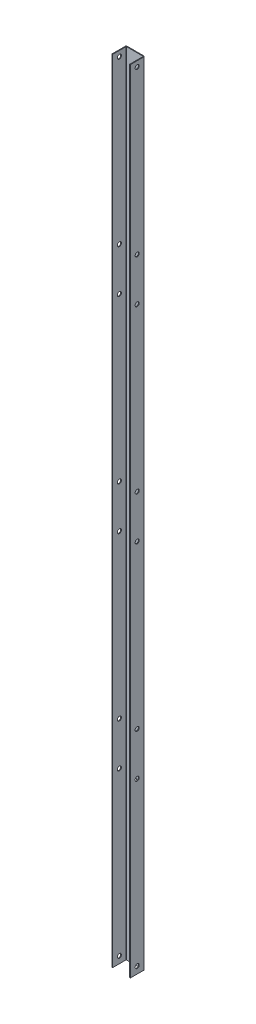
ISO-10303-21;
HEADER;
FILE_DESCRIPTION(('STEP AP214'),'2;1');
FILE_NAME('part.step','',(''),(''),'','','');
FILE_SCHEMA(('AUTOMOTIVE_DESIGN { 1 0 10303 214 1 1 1 1 }'));
ENDSEC;
DATA;
#1=APPLICATION_CONTEXT('core data for automotive mechanical design processes');
#2=APPLICATION_PROTOCOL_DEFINITION('international standard','automotive_design',2000,#1);
#3=PRODUCT_CONTEXT('',#1,'mechanical');
#4=PRODUCT('Part','Part','',(#3));
#5=PRODUCT_RELATED_PRODUCT_CATEGORY('part','',(#4));
#6=PRODUCT_DEFINITION_FORMATION('','',#4);
#7=PRODUCT_DEFINITION_CONTEXT('part definition',#1,'design');
#8=PRODUCT_DEFINITION('design','',#6,#7);
#9=PRODUCT_DEFINITION_SHAPE('','',#8);
#10=(LENGTH_UNIT() NAMED_UNIT(*) SI_UNIT(.MILLI.,.METRE.));
#11=(NAMED_UNIT(*) PLANE_ANGLE_UNIT() SI_UNIT($,.RADIAN.));
#12=(NAMED_UNIT(*) SI_UNIT($,.STERADIAN.) SOLID_ANGLE_UNIT());
#13=UNCERTAINTY_MEASURE_WITH_UNIT(LENGTH_MEASURE(1.E-05),#10,'distance_accuracy_value','');
#14=(GEOMETRIC_REPRESENTATION_CONTEXT(3) GLOBAL_UNCERTAINTY_ASSIGNED_CONTEXT((#13)) GLOBAL_UNIT_ASSIGNED_CONTEXT((#10,
#11,#12)) REPRESENTATION_CONTEXT('',''));
#15=CARTESIAN_POINT('',(0.,0.,0.));
#16=DIRECTION('',(0.,0.,1.));
#17=DIRECTION('',(1.,0.,0.));
#18=AXIS2_PLACEMENT_3D('',#15,#16,#17);
#19=CARTESIAN_POINT('',(130.,1155.,0.));
#20=DIRECTION('',(0.,-1.,0.));
#21=DIRECTION('',(0.,0.,-1.));
#22=AXIS2_PLACEMENT_3D('',#19,#20,#21);
#23=PLANE('',#22);
#24=DIRECTION('',(0.,0.,1.));
#25=VECTOR('',#24,1.);
#26=CARTESIAN_POINT('',(2.,1155.,0.));
#27=LINE('',#26,#25);
#28=CARTESIAN_POINT('',(2.,1155.,-39.2634));
#29=VERTEX_POINT('',#28);
#30=CARTESIAN_POINT('',(2.,1155.,0.));
#31=VERTEX_POINT('',#30);
#32=EDGE_CURVE('E430',#29,#31,#27,.T.);
#33=ORIENTED_EDGE('',*,*,#32,.F.);
#34=DIRECTION('',(-1.,0.,0.));
#35=VECTOR('',#34,1.);
#36=CARTESIAN_POINT('',(2.,1155.,-39.2634));
#37=LINE('',#36,#35);
#38=CARTESIAN_POINT('',(0.,1155.,-39.2634));
#39=VERTEX_POINT('',#38);
#40=EDGE_CURVE('E11',#29,#39,#37,.T.);
#41=ORIENTED_EDGE('',*,*,#40,.T.);
#42=DIRECTION('',(0.,0.,1.));
#43=VECTOR('',#42,1.);
#44=CARTESIAN_POINT('',(0.,1155.,0.));
#45=LINE('',#44,#43);
#46=CARTESIAN_POINT('',(0.,1155.,0.));
#47=VERTEX_POINT('',#46);
#48=EDGE_CURVE('E427',#39,#47,#45,.T.);
#49=ORIENTED_EDGE('',*,*,#48,.T.);
#50=DIRECTION('',(-1.,0.,0.));
#51=VECTOR('',#50,1.);
#52=CARTESIAN_POINT('',(130.,1155.,0.));
#53=LINE('',#52,#51);
#54=EDGE_CURVE('E153',#31,#47,#53,.T.);
#55=ORIENTED_EDGE('',*,*,#54,.F.);
#56=EDGE_LOOP('',(#33,#41,#49,#55));
#57=FACE_BOUND('',#56,.T.);
#58=ADVANCED_FACE('F43',(#57),#23,.F.);
#59=DIRECTION('',(1.,0.,0.));
#60=VECTOR('',#59,1.);
#61=CARTESIAN_POINT('',(0.,1155.,-40.));
#62=LINE('',#61,#60);
#63=CARTESIAN_POINT('',(-49.2634,1155.,-40.));
#64=VERTEX_POINT('',#63);
#65=CARTESIAN_POINT('',(-0.7366,1155.,-40.));
#66=VERTEX_POINT('',#65);
#67=EDGE_CURVE('E419',#64,#66,#62,.T.);
#68=ORIENTED_EDGE('',*,*,#67,.T.);
#69=DIRECTION('',(0.,0.,-1.));
#70=VECTOR('',#69,1.);
#71=CARTESIAN_POINT('',(-0.7366,1155.,-40.));
#72=LINE('',#71,#70);
#73=CARTESIAN_POINT('',(-0.7366,1155.,-42.));
#74=VERTEX_POINT('',#73);
#75=EDGE_CURVE('E53',#66,#74,#72,.T.);
#76=ORIENTED_EDGE('',*,*,#75,.T.);
#77=DIRECTION('',(1.,0.,0.));
#78=VECTOR('',#77,1.);
#79=CARTESIAN_POINT('',(0.,1155.,-42.));
#80=LINE('',#79,#78);
#81=CARTESIAN_POINT('',(-49.2634,1155.,-42.));
#82=VERTEX_POINT('',#81);
#83=EDGE_CURVE('E438',#82,#74,#80,.T.);
#84=ORIENTED_EDGE('',*,*,#83,.F.);
#85=DIRECTION('',(0.,0.,1.));
#86=VECTOR('',#85,1.);
#87=CARTESIAN_POINT('',(-49.2634,1155.,-42.));
#88=LINE('',#87,#86);
#89=EDGE_CURVE('E177',#82,#64,#88,.T.);
#90=ORIENTED_EDGE('',*,*,#89,.T.);
#91=EDGE_LOOP('',(#68,#76,#84,#90));
#92=FACE_BOUND('',#91,.T.);
#93=ADVANCED_FACE('F600',(#92),#23,.F.);
#94=ORIENTED_EDGE('',*,*,#40,.F.);
#95=CARTESIAN_POINT('',(-0.7366,1155.,-39.2634));
#96=DIRECTION('',(0.,-1.,0.));
#97=DIRECTION('',(0.,0.,-1.));
#98=AXIS2_PLACEMENT_3D('',#95,#96,#97);
#99=CIRCLE('',#98,2.7366);
#100=EDGE_CURVE('E434',#74,#29,#99,.T.);
#101=ORIENTED_EDGE('',*,*,#100,.F.);
#102=ORIENTED_EDGE('',*,*,#75,.F.);
#103=CARTESIAN_POINT('',(-0.7366,1155.,-39.2634));
#104=DIRECTION('',(0.,-1.,0.));
#105=DIRECTION('',(0.,0.,-1.));
#106=AXIS2_PLACEMENT_3D('',#103,#104,#105);
#107=CIRCLE('',#106,0.7366);
#108=EDGE_CURVE('E423',#66,#39,#107,.T.);
#109=ORIENTED_EDGE('',*,*,#108,.T.);
#110=EDGE_LOOP('',(#94,#101,#102,#109));
#111=FACE_BOUND('',#110,.T.);
#112=ADVANCED_FACE('F510',(#111),#23,.F.);
#113=DIRECTION('',(0.,0.,-1.));
#114=VECTOR('',#113,1.);
#115=CARTESIAN_POINT('',(-50.,1155.,-40.));
#116=LINE('',#115,#114);
#117=CARTESIAN_POINT('',(-50.,1155.,0.));
#118=VERTEX_POINT('',#117);
#119=CARTESIAN_POINT('',(-50.,1155.,-39.2634));
#120=VERTEX_POINT('',#119);
#121=EDGE_CURVE('E412',#118,#120,#116,.T.);
#122=ORIENTED_EDGE('',*,*,#121,.T.);
#123=DIRECTION('',(-1.,0.,0.));
#124=VECTOR('',#123,1.);
#125=CARTESIAN_POINT('',(-50.,1155.,-39.2634));
#126=LINE('',#125,#124);
#127=CARTESIAN_POINT('',(-52.,1155.,-39.2634));
#128=VERTEX_POINT('',#127);
#129=EDGE_CURVE('E61',#120,#128,#126,.T.);
#130=ORIENTED_EDGE('',*,*,#129,.T.);
#131=DIRECTION('',(0.,0.,1.));
#132=VECTOR('',#131,1.);
#133=CARTESIAN_POINT('',(-52.,1155.,0.));
#134=LINE('',#133,#132);
#135=CARTESIAN_POINT('',(-52.,1155.,0.));
#136=VERTEX_POINT('',#135);
#137=EDGE_CURVE('E133',#128,#136,#134,.T.);
#138=ORIENTED_EDGE('',*,*,#137,.T.);
#139=EDGE_CURVE('E136',#118,#136,#53,.T.);
#140=ORIENTED_EDGE('',*,*,#139,.F.);
#141=EDGE_LOOP('',(#122,#130,#138,#140));
#142=FACE_BOUND('',#141,.T.);
#143=ADVANCED_FACE('F135',(#142),#23,.F.);
#144=CARTESIAN_POINT('',(130.,-1155.,0.));
#145=DIRECTION('',(0.,1.,0.));
#146=DIRECTION('',(0.,0.,1.));
#147=AXIS2_PLACEMENT_3D('',#144,#145,#146);
#148=PLANE('',#147);
#149=DIRECTION('',(0.,0.,-1.));
#150=VECTOR('',#149,1.);
#151=CARTESIAN_POINT('',(-52.,-1155.,0.));
#152=LINE('',#151,#150);
#153=CARTESIAN_POINT('',(-52.,-1155.,0.));
#154=VERTEX_POINT('',#153);
#155=CARTESIAN_POINT('',(-52.,-1155.,-39.2634));
#156=VERTEX_POINT('',#155);
#157=EDGE_CURVE('E155',#154,#156,#152,.T.);
#158=ORIENTED_EDGE('',*,*,#157,.T.);
#159=DIRECTION('',(1.,1.11022302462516E-13,0.));
#160=VECTOR('',#159,1.);
#161=CARTESIAN_POINT('',(-52.,-1155.,-39.2634));
#162=LINE('',#161,#160);
#163=CARTESIAN_POINT('',(-50.,-1155.,-39.2634));
#164=VERTEX_POINT('',#163);
#165=EDGE_CURVE('E172',#156,#164,#162,.T.);
#166=ORIENTED_EDGE('',*,*,#165,.T.);
#167=DIRECTION('',(0.,0.,1.));
#168=VECTOR('',#167,1.);
#169=CARTESIAN_POINT('',(-50.,-1155.,-40.));
#170=LINE('',#169,#168);
#171=CARTESIAN_POINT('',(-50.,-1155.,0.));
#172=VERTEX_POINT('',#171);
#173=EDGE_CURVE('E377',#164,#172,#170,.T.);
#174=ORIENTED_EDGE('',*,*,#173,.T.);
#175=DIRECTION('',(-1.,0.,0.));
#176=VECTOR('',#175,1.);
#177=CARTESIAN_POINT('',(130.,-1155.,0.));
#178=LINE('',#177,#176);
#179=EDGE_CURVE('E69',#172,#154,#178,.T.);
#180=ORIENTED_EDGE('',*,*,#179,.T.);
#181=EDGE_LOOP('',(#158,#166,#174,#180));
#182=FACE_BOUND('',#181,.T.);
#183=ADVANCED_FACE('F491',(#182),#148,.F.);
#184=DIRECTION('',(-1.,0.,0.));
#185=VECTOR('',#184,1.);
#186=CARTESIAN_POINT('',(0.,-1155.,-40.));
#187=LINE('',#186,#185);
#188=CARTESIAN_POINT('',(-0.7366,-1155.,-40.));
#189=VERTEX_POINT('',#188);
#190=CARTESIAN_POINT('',(-49.2634,-1155.,-40.));
#191=VERTEX_POINT('',#190);
#192=EDGE_CURVE('E384',#189,#191,#187,.T.);
#193=ORIENTED_EDGE('',*,*,#192,.T.);
#194=DIRECTION('',(0.,0.,-1.));
#195=VECTOR('',#194,1.);
#196=CARTESIAN_POINT('',(-49.2634,-1155.,-40.));
#197=LINE('',#196,#195);
#198=CARTESIAN_POINT('',(-49.2634,-1155.,-42.));
#199=VERTEX_POINT('',#198);
#200=EDGE_CURVE('E169',#191,#199,#197,.T.);
#201=ORIENTED_EDGE('',*,*,#200,.T.);
#202=DIRECTION('',(-1.,0.,0.));
#203=VECTOR('',#202,1.);
#204=CARTESIAN_POINT('',(0.,-1155.,-42.));
#205=LINE('',#204,#203);
#206=CARTESIAN_POINT('',(-0.7366,-1155.,-42.));
#207=VERTEX_POINT('',#206);
#208=EDGE_CURVE('E404',#207,#199,#205,.T.);
#209=ORIENTED_EDGE('',*,*,#208,.F.);
#210=DIRECTION('',(0.,0.,1.));
#211=VECTOR('',#210,1.);
#212=CARTESIAN_POINT('',(-0.7366,-1155.,-42.));
#213=LINE('',#212,#211);
#214=EDGE_CURVE('E157',#207,#189,#213,.T.);
#215=ORIENTED_EDGE('',*,*,#214,.T.);
#216=EDGE_LOOP('',(#193,#201,#209,#215));
#217=FACE_BOUND('',#216,.T.);
#218=ADVANCED_FACE('F498',(#217),#148,.F.);
#219=DIRECTION('',(0.,0.,-1.));
#220=VECTOR('',#219,1.);
#221=CARTESIAN_POINT('',(0.,-1155.,0.));
#222=LINE('',#221,#220);
#223=CARTESIAN_POINT('',(0.,-1155.,0.));
#224=VERTEX_POINT('',#223);
#225=CARTESIAN_POINT('',(0.,-1155.,-39.2634));
#226=VERTEX_POINT('',#225);
#227=EDGE_CURVE('E392',#224,#226,#222,.T.);
#228=ORIENTED_EDGE('',*,*,#227,.T.);
#229=DIRECTION('',(1.,0.,0.));
#230=VECTOR('',#229,1.);
#231=CARTESIAN_POINT('',(0.,-1155.,-39.2634));
#232=LINE('',#231,#230);
#233=CARTESIAN_POINT('',(2.,-1155.,-39.2634));
#234=VERTEX_POINT('',#233);
#235=EDGE_CURVE('E161',#226,#234,#232,.T.);
#236=ORIENTED_EDGE('',*,*,#235,.T.);
#237=DIRECTION('',(0.,0.,-1.));
#238=VECTOR('',#237,1.);
#239=CARTESIAN_POINT('',(2.,-1155.,0.));
#240=LINE('',#239,#238);
#241=CARTESIAN_POINT('',(2.,-1155.,0.));
#242=VERTEX_POINT('',#241);
#243=EDGE_CURVE('E396',#242,#234,#240,.T.);
#244=ORIENTED_EDGE('',*,*,#243,.F.);
#245=EDGE_CURVE('E143',#242,#224,#178,.T.);
#246=ORIENTED_EDGE('',*,*,#245,.T.);
#247=EDGE_LOOP('',(#228,#236,#244,#246));
#248=FACE_BOUND('',#247,.T.);
#249=ADVANCED_FACE('F606',(#248),#148,.F.);
#250=ORIENTED_EDGE('',*,*,#165,.F.);
#251=CARTESIAN_POINT('',(-49.2634,-1155.,-39.2634));
#252=DIRECTION('',(0.,1.,0.));
#253=DIRECTION('',(0.,0.,1.));
#254=AXIS2_PLACEMENT_3D('',#251,#252,#253);
#255=CIRCLE('',#254,2.7366);
#256=EDGE_CURVE('E408',#199,#156,#255,.T.);
#257=ORIENTED_EDGE('',*,*,#256,.F.);
#258=ORIENTED_EDGE('',*,*,#200,.F.);
#259=CARTESIAN_POINT('',(-49.2634,-1155.,-39.2634));
#260=DIRECTION('',(0.,1.,0.));
#261=DIRECTION('',(0.,0.,1.));
#262=AXIS2_PLACEMENT_3D('',#259,#260,#261);
#263=CIRCLE('',#262,0.7366);
#264=EDGE_CURVE('E380',#191,#164,#263,.T.);
#265=ORIENTED_EDGE('',*,*,#264,.T.);
#266=EDGE_LOOP('',(#250,#257,#258,#265));
#267=FACE_BOUND('',#266,.T.);
#268=ADVANCED_FACE('F494',(#267),#148,.F.);
#269=CARTESIAN_POINT('',(-49.2634,1310.,-39.2634));
#270=DIRECTION('',(0.,-1.,0.));
#271=DIRECTION('',(0.,0.,-1.));
#272=AXIS2_PLACEMENT_3D('',#269,#270,#271);
#273=CYLINDRICAL_SURFACE('',#272,2.7366);
#274=DIRECTION('',(0.,-1.,0.));
#275=VECTOR('',#274,1.);
#276=CARTESIAN_POINT('',(-52.,1310.,-39.2634));
#277=LINE('',#276,#275);
#278=EDGE_CURVE('E446',#128,#156,#277,.T.);
#279=ORIENTED_EDGE('',*,*,#278,.F.);
#280=CARTESIAN_POINT('',(-49.2634,1155.,-39.2634));
#281=DIRECTION('',(0.,-1.,0.));
#282=DIRECTION('',(0.,0.,-1.));
#283=AXIS2_PLACEMENT_3D('',#280,#281,#282);
#284=CIRCLE('',#283,2.7366);
#285=EDGE_CURVE('E442',#128,#82,#284,.T.);
#286=ORIENTED_EDGE('',*,*,#285,.T.);
#287=DIRECTION('',(0.,-1.,0.));
#288=VECTOR('',#287,1.);
#289=CARTESIAN_POINT('',(-49.2634,1310.,-42.));
#290=LINE('',#289,#288);
#291=EDGE_CURVE('E449',#82,#199,#290,.T.);
#292=ORIENTED_EDGE('',*,*,#291,.T.);
#293=ORIENTED_EDGE('',*,*,#256,.T.);
#294=EDGE_LOOP('',(#279,#286,#292,#293));
#295=FACE_BOUND('',#294,.T.);
#296=ADVANCED_FACE('F571',(#295),#273,.T.);
#297=CARTESIAN_POINT('',(0.,1310.,-42.));
#298=DIRECTION('',(0.,0.,1.));
#299=DIRECTION('',(1.,0.,0.));
#300=AXIS2_PLACEMENT_3D('',#297,#298,#299);
#301=PLANE('',#300);
#302=CARTESIAN_POINT('',(-24.7395875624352,-327.884361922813,-42.));
#303=DIRECTION('',(0.,0.,-1.));
#304=DIRECTION('',(-1.,0.,0.));
#305=AXIS2_PLACEMENT_3D('',#302,#303,#304);
#306=CIRCLE('',#305,6.00000000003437);
#307=CARTESIAN_POINT('',(-30.7395875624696,-327.884361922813,-42.));
#308=VERTEX_POINT('',#307);
#309=EDGE_CURVE('E261',#308,#308,#306,.T.);
#310=ORIENTED_EDGE('',*,*,#309,.F.);
#311=EDGE_LOOP('',(#310));
#312=FACE_BOUND('',#311,.T.);
#313=CARTESIAN_POINT('',(-24.7395875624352,-367.884361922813,-42.));
#314=DIRECTION('',(0.,0.,-1.));
#315=DIRECTION('',(-1.,0.,0.));
#316=AXIS2_PLACEMENT_3D('',#313,#314,#315);
#317=CIRCLE('',#316,6.00000000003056);
#318=CARTESIAN_POINT('',(-30.7395875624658,-367.884361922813,-42.));
#319=VERTEX_POINT('',#318);
#320=EDGE_CURVE('E557',#319,#319,#317,.T.);
#321=ORIENTED_EDGE('',*,*,#320,.F.);
#322=EDGE_LOOP('',(#321));
#323=FACE_BOUND('',#322,.T.);
#324=CARTESIAN_POINT('',(-24.9999999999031,-686.088388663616,-42.));
#325=DIRECTION('',(0.,0.,-1.));
#326=DIRECTION('',(-1.,0.,0.));
#327=AXIS2_PLACEMENT_3D('',#324,#325,#326);
#328=CIRCLE('',#327,6.00000000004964);
#329=CARTESIAN_POINT('',(-30.9999999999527,-686.088388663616,-42.));
#330=VERTEX_POINT('',#329);
#331=EDGE_CURVE('E553',#330,#330,#328,.T.);
#332=ORIENTED_EDGE('',*,*,#331,.F.);
#333=EDGE_LOOP('',(#332));
#334=FACE_BOUND('',#333,.T.);
#335=CARTESIAN_POINT('',(-24.9999999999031,-726.088388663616,-42.));
#336=DIRECTION('',(0.,0.,-1.));
#337=DIRECTION('',(-1.,0.,0.));
#338=AXIS2_PLACEMENT_3D('',#335,#336,#337);
#339=CIRCLE('',#338,6.00000000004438);
#340=CARTESIAN_POINT('',(-30.9999999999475,-726.088388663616,-42.));
#341=VERTEX_POINT('',#340);
#342=EDGE_CURVE('E549',#341,#341,#339,.T.);
#343=ORIENTED_EDGE('',*,*,#342,.F.);
#344=EDGE_LOOP('',(#343));
#345=FACE_BOUND('',#344,.T.);
#346=CARTESIAN_POINT('',(-24.7395875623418,-1049.36105815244,-42.));
#347=DIRECTION('',(0.,0.,-1.));
#348=DIRECTION('',(-1.,0.,0.));
#349=AXIS2_PLACEMENT_3D('',#346,#347,#348);
#350=CIRCLE('',#349,6.00000000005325);
#351=CARTESIAN_POINT('',(-30.7395875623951,-1049.36105815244,-42.));
#352=VERTEX_POINT('',#351);
#353=EDGE_CURVE('E545',#352,#352,#350,.T.);
#354=ORIENTED_EDGE('',*,*,#353,.F.);
#355=EDGE_LOOP('',(#354));
#356=FACE_BOUND('',#355,.T.);
#357=CARTESIAN_POINT('',(-24.7395875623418,-1089.36105815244,-42.));
#358=DIRECTION('',(0.,0.,-1.));
#359=DIRECTION('',(-1.,0.,0.));
#360=AXIS2_PLACEMENT_3D('',#357,#358,#359);
#361=CIRCLE('',#360,6.00000000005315);
#362=CARTESIAN_POINT('',(-30.739587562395,-1089.36105815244,-42.));
#363=VERTEX_POINT('',#362);
#364=EDGE_CURVE('E541',#363,#363,#361,.T.);
#365=ORIENTED_EDGE('',*,*,#364,.F.);
#366=EDGE_LOOP('',(#365));
#367=FACE_BOUND('',#366,.T.);
#368=CARTESIAN_POINT('',(-24.7395875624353,850.638941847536,-42.));
#369=DIRECTION('',(0.,0.,-1.));
#370=DIRECTION('',(-1.,0.,0.));
#371=AXIS2_PLACEMENT_3D('',#368,#369,#370);
#372=CIRCLE('',#371,5.99999999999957);
#373=CARTESIAN_POINT('',(-30.7395875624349,850.638941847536,-42.));
#374=VERTEX_POINT('',#373);
#375=EDGE_CURVE('E235',#374,#374,#372,.T.);
#376=ORIENTED_EDGE('',*,*,#375,.F.);
#377=EDGE_LOOP('',(#376));
#378=FACE_BOUND('',#377,.T.);
#379=CARTESIAN_POINT('',(-24.7395875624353,810.638941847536,-42.));
#380=DIRECTION('',(0.,0.,-1.));
#381=DIRECTION('',(-1.,0.,0.));
#382=AXIS2_PLACEMENT_3D('',#379,#380,#381);
#383=CIRCLE('',#382,5.99999999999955);
#384=CARTESIAN_POINT('',(-30.7395875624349,810.638941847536,-42.));
#385=VERTEX_POINT('',#384);
#386=EDGE_CURVE('E528',#385,#385,#383,.T.);
#387=ORIENTED_EDGE('',*,*,#386,.F.);
#388=EDGE_LOOP('',(#387));
#389=FACE_BOUND('',#388,.T.);
#390=CARTESIAN_POINT('',(-24.9999999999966,493.911611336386,-42.));
#391=DIRECTION('',(0.,0.,-1.));
#392=DIRECTION('',(-1.,0.,0.));
#393=AXIS2_PLACEMENT_3D('',#390,#391,#392);
#394=CIRCLE('',#393,6.00000000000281);
#395=CARTESIAN_POINT('',(-30.9999999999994,493.911611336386,-42.));
#396=VERTEX_POINT('',#395);
#397=EDGE_CURVE('E532',#396,#396,#394,.T.);
#398=ORIENTED_EDGE('',*,*,#397,.F.);
#399=EDGE_LOOP('',(#398));
#400=FACE_BOUND('',#399,.T.);
#401=CARTESIAN_POINT('',(-24.9999999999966,453.911611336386,-42.));
#402=DIRECTION('',(0.,0.,-1.));
#403=DIRECTION('',(-1.,0.,0.));
#404=AXIS2_PLACEMENT_3D('',#401,#402,#403);
#405=CIRCLE('',#404,6.00000000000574);
#406=CARTESIAN_POINT('',(-31.0000000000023,453.911611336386,-42.));
#407=VERTEX_POINT('',#406);
#408=EDGE_CURVE('E290',#407,#407,#405,.T.);
#409=ORIENTED_EDGE('',*,*,#408,.F.);
#410=EDGE_LOOP('',(#409));
#411=FACE_BOUND('',#410,.T.);
#412=CARTESIAN_POINT('',(-24.7395875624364,130.638941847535,-42.));
#413=DIRECTION('',(0.,0.,-1.));
#414=DIRECTION('',(-1.,0.,0.));
#415=AXIS2_PLACEMENT_3D('',#412,#413,#414);
#416=CIRCLE('',#415,5.99999999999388);
#417=CARTESIAN_POINT('',(-30.7395875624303,130.638941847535,-42.));
#418=VERTEX_POINT('',#417);
#419=EDGE_CURVE('E284',#418,#418,#416,.T.);
#420=ORIENTED_EDGE('',*,*,#419,.F.);
#421=EDGE_LOOP('',(#420));
#422=FACE_BOUND('',#421,.T.);
#423=CARTESIAN_POINT('',(-24.7395875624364,90.6389418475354,-42.));
#424=DIRECTION('',(0.,0.,-1.));
#425=DIRECTION('',(-1.,0.,0.));
#426=AXIS2_PLACEMENT_3D('',#423,#424,#425);
#427=CIRCLE('',#426,5.99999999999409);
#428=CARTESIAN_POINT('',(-30.7395875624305,90.6389418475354,-42.));
#429=VERTEX_POINT('',#428);
#430=EDGE_CURVE('E279',#429,#429,#427,.T.);
#431=ORIENTED_EDGE('',*,*,#430,.F.);
#432=EDGE_LOOP('',(#431));
#433=FACE_BOUND('',#432,.T.);
#434=ORIENTED_EDGE('',*,*,#291,.F.);
#435=ORIENTED_EDGE('',*,*,#83,.T.);
#436=DIRECTION('',(0.,-1.,0.));
#437=VECTOR('',#436,1.);
#438=CARTESIAN_POINT('',(-0.7366,1310.,-42.));
#439=LINE('',#438,#437);
#440=EDGE_CURVE('E453',#74,#207,#439,.T.);
#441=ORIENTED_EDGE('',*,*,#440,.T.);
#442=ORIENTED_EDGE('',*,*,#208,.T.);
#443=EDGE_LOOP('',(#434,#435,#441,#442));
#444=FACE_BOUND('',#443,.T.);
#445=ADVANCED_FACE('F567',(#312,#323,#334,#345,#356,#367,#378,#389,#400,#411,#422,#433,#444),
#301,.F.);
#446=CARTESIAN_POINT('',(-0.7366,1310.,-39.2634));
#447=DIRECTION('',(0.,-1.,0.));
#448=DIRECTION('',(0.,0.,-1.));
#449=AXIS2_PLACEMENT_3D('',#446,#447,#448);
#450=CYLINDRICAL_SURFACE('',#449,2.7366);
#451=ORIENTED_EDGE('',*,*,#440,.F.);
#452=ORIENTED_EDGE('',*,*,#100,.T.);
#453=DIRECTION('',(0.,-1.,0.));
#454=VECTOR('',#453,1.);
#455=CARTESIAN_POINT('',(2.,1310.,-39.2634));
#456=LINE('',#455,#454);
#457=EDGE_CURVE('E457',#29,#234,#456,.T.);
#458=ORIENTED_EDGE('',*,*,#457,.T.);
#459=CARTESIAN_POINT('',(-0.7366,-1155.,-39.2634));
#460=DIRECTION('',(0.,1.,0.));
#461=DIRECTION('',(0.,0.,1.));
#462=AXIS2_PLACEMENT_3D('',#459,#460,#461);
#463=CIRCLE('',#462,2.7366);
#464=EDGE_CURVE('E400',#234,#207,#463,.T.);
#465=ORIENTED_EDGE('',*,*,#464,.T.);
#466=EDGE_LOOP('',(#451,#452,#458,#465));
#467=FACE_BOUND('',#466,.T.);
#468=ADVANCED_FACE('F570',(#467),#450,.T.);
#469=CARTESIAN_POINT('',(2.,1310.,0.));
#470=DIRECTION('',(-1.,0.,0.));
#471=DIRECTION('',(0.,0.,1.));
#472=AXIS2_PLACEMENT_3D('',#469,#470,#471);
#473=PLANE('',#472);
#474=CARTESIAN_POINT('',(2.,1138.99999999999,-20.000000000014));
#475=DIRECTION('',(1.,0.,0.));
#476=DIRECTION('',(0.,0.,-1.));
#477=AXIS2_PLACEMENT_3D('',#474,#475,#476);
#478=CIRCLE('',#477,5.99999999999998);
#479=CARTESIAN_POINT('',(2.,1138.99999999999,-26.000000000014));
#480=VERTEX_POINT('',#479);
#481=EDGE_CURVE('E187',#480,#480,#478,.T.);
#482=ORIENTED_EDGE('',*,*,#481,.F.);
#483=EDGE_LOOP('',(#482));
#484=FACE_BOUND('',#483,.T.);
#485=CARTESIAN_POINT('',(2.,664.999999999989,-20.0000000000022));
#486=DIRECTION('',(1.,0.,0.));
#487=DIRECTION('',(0.,0.,-1.));
#488=AXIS2_PLACEMENT_3D('',#485,#486,#487);
#489=CIRCLE('',#488,5.99999999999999);
#490=CARTESIAN_POINT('',(2.,664.999999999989,-26.0000000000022));
#491=VERTEX_POINT('',#490);
#492=EDGE_CURVE('E297',#491,#491,#489,.T.);
#493=ORIENTED_EDGE('',*,*,#492,.F.);
#494=EDGE_LOOP('',(#493));
#495=FACE_BOUND('',#494,.T.);
#496=CARTESIAN_POINT('',(2.,538.999999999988,-20.0000000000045));
#497=DIRECTION('',(1.,0.,0.));
#498=DIRECTION('',(0.,0.,-1.));
#499=AXIS2_PLACEMENT_3D('',#496,#497,#498);
#500=CIRCLE('',#499,6.00000000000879);
#501=CARTESIAN_POINT('',(2.,538.999999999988,-26.0000000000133));
#502=VERTEX_POINT('',#501);
#503=EDGE_CURVE('E301',#502,#502,#500,.T.);
#504=ORIENTED_EDGE('',*,*,#503,.F.);
#505=EDGE_LOOP('',(#504));
#506=FACE_BOUND('',#505,.T.);
#507=CARTESIAN_POINT('',(2.,64.9999999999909,-19.999999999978));
#508=DIRECTION('',(1.,0.,0.));
#509=DIRECTION('',(0.,0.,-1.));
#510=AXIS2_PLACEMENT_3D('',#507,#508,#509);
#511=CIRCLE('',#510,6.00000000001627);
#512=CARTESIAN_POINT('',(2.,64.9999999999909,-25.9999999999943));
#513=VERTEX_POINT('',#512);
#514=EDGE_CURVE('E305',#513,#513,#511,.T.);
#515=ORIENTED_EDGE('',*,*,#514,.F.);
#516=EDGE_LOOP('',(#515));
#517=FACE_BOUND('',#516,.T.);
#518=CARTESIAN_POINT('',(2.,-61.0000000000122,-19.9999999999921));
#519=DIRECTION('',(1.,0.,0.));
#520=DIRECTION('',(0.,0.,-1.));
#521=AXIS2_PLACEMENT_3D('',#518,#519,#520);
#522=CIRCLE('',#521,6.0000000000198);
#523=CARTESIAN_POINT('',(2.,-61.0000000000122,-26.000000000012));
#524=VERTEX_POINT('',#523);
#525=EDGE_CURVE('E309',#524,#524,#522,.T.);
#526=ORIENTED_EDGE('',*,*,#525,.F.);
#527=EDGE_LOOP('',(#526));
#528=FACE_BOUND('',#527,.T.);
#529=CARTESIAN_POINT('',(2.,-535.00000000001,-19.9999999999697));
#530=DIRECTION('',(1.,0.,0.));
#531=DIRECTION('',(0.,0.,-1.));
#532=AXIS2_PLACEMENT_3D('',#529,#530,#531);
#533=CIRCLE('',#532,6.00000000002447);
#534=CARTESIAN_POINT('',(2.,-535.00000000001,-25.9999999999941));
#535=VERTEX_POINT('',#534);
#536=EDGE_CURVE('E313',#535,#535,#533,.T.);
#537=ORIENTED_EDGE('',*,*,#536,.F.);
#538=EDGE_LOOP('',(#537));
#539=FACE_BOUND('',#538,.T.);
#540=CARTESIAN_POINT('',(2.,-661.000000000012,-19.999999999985));
#541=DIRECTION('',(1.,0.,0.));
#542=DIRECTION('',(0.,0.,-1.));
#543=AXIS2_PLACEMENT_3D('',#540,#541,#542);
#544=CIRCLE('',#543,6.00000000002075);
#545=CARTESIAN_POINT('',(2.,-661.000000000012,-26.0000000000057));
#546=VERTEX_POINT('',#545);
#547=EDGE_CURVE('E317',#546,#546,#544,.T.);
#548=ORIENTED_EDGE('',*,*,#547,.F.);
#549=EDGE_LOOP('',(#548));
#550=FACE_BOUND('',#549,.T.);
#551=CARTESIAN_POINT('',(2.,-1135.00000000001,-19.9999999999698));
#552=DIRECTION('',(1.,0.,0.));
#553=DIRECTION('',(0.,0.,-1.));
#554=AXIS2_PLACEMENT_3D('',#551,#552,#553);
#555=CIRCLE('',#554,6.00000000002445);
#556=CARTESIAN_POINT('',(2.,-1135.00000000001,-25.9999999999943));
#557=VERTEX_POINT('',#556);
#558=EDGE_CURVE('E255',#557,#557,#555,.T.);
#559=ORIENTED_EDGE('',*,*,#558,.F.);
#560=EDGE_LOOP('',(#559));
#561=FACE_BOUND('',#560,.T.);
#562=ORIENTED_EDGE('',*,*,#457,.F.);
#563=ORIENTED_EDGE('',*,*,#32,.T.);
#564=DIRECTION('',(0.,-1.,0.));
#565=VECTOR('',#564,1.);
#566=CARTESIAN_POINT('',(2.,1310.,0.));
#567=LINE('',#566,#565);
#568=EDGE_CURVE('E461',#31,#242,#567,.T.);
#569=ORIENTED_EDGE('',*,*,#568,.T.);
#570=ORIENTED_EDGE('',*,*,#243,.T.);
#571=EDGE_LOOP('',(#562,#563,#569,#570));
#572=FACE_BOUND('',#571,.T.);
#573=ADVANCED_FACE('F604',(#484,#495,#506,#517,#528,#539,#550,#561,#572),#473,.F.);
#574=CARTESIAN_POINT('',(2.,1310.,0.));
#575=DIRECTION('',(0.,0.,1.));
#576=DIRECTION('',(1.,0.,0.));
#577=AXIS2_PLACEMENT_3D('',#574,#575,#576);
#578=PLANE('',#577);
#579=ORIENTED_EDGE('',*,*,#54,.T.);
#580=DIRECTION('',(0.,-1.,0.));
#581=VECTOR('',#580,1.);
#582=CARTESIAN_POINT('',(0.,1310.,0.));
#583=LINE('',#582,#581);
#584=EDGE_CURVE('E465',#47,#224,#583,.T.);
#585=ORIENTED_EDGE('',*,*,#584,.T.);
#586=ORIENTED_EDGE('',*,*,#245,.F.);
#587=ORIENTED_EDGE('',*,*,#568,.F.);
#588=EDGE_LOOP('',(#579,#585,#586,#587));
#589=FACE_BOUND('',#588,.T.);
#590=ADVANCED_FACE('F521',(#589),#578,.T.);
#591=CARTESIAN_POINT('',(0.,1310.,0.));
#592=DIRECTION('',(-1.,0.,0.));
#593=DIRECTION('',(0.,0.,1.));
#594=AXIS2_PLACEMENT_3D('',#591,#592,#593);
#595=PLANE('',#594);
#596=CARTESIAN_POINT('',(0.,1138.99999999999,-20.000000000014));
#597=DIRECTION('',(-1.,0.,0.));
#598=DIRECTION('',(0.,0.,1.));
#599=AXIS2_PLACEMENT_3D('',#596,#597,#598);
#600=CIRCLE('',#599,5.99999999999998);
#601=CARTESIAN_POINT('',(0.,1138.99999999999,-14.000000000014));
#602=VERTEX_POINT('',#601);
#603=EDGE_CURVE('E369',#602,#602,#600,.T.);
#604=ORIENTED_EDGE('',*,*,#603,.F.);
#605=EDGE_LOOP('',(#604));
#606=FACE_BOUND('',#605,.T.);
#607=CARTESIAN_POINT('',(0.,664.999999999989,-20.0000000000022));
#608=DIRECTION('',(-1.,0.,0.));
#609=DIRECTION('',(0.,0.,1.));
#610=AXIS2_PLACEMENT_3D('',#607,#608,#609);
#611=CIRCLE('',#610,5.99999999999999);
#612=CARTESIAN_POINT('',(0.,664.999999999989,-14.0000000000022));
#613=VERTEX_POINT('',#612);
#614=EDGE_CURVE('E229',#613,#613,#611,.T.);
#615=ORIENTED_EDGE('',*,*,#614,.F.);
#616=EDGE_LOOP('',(#615));
#617=FACE_BOUND('',#616,.T.);
#618=CARTESIAN_POINT('',(0.,538.999999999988,-20.0000000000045));
#619=DIRECTION('',(-1.,0.,0.));
#620=DIRECTION('',(0.,0.,1.));
#621=AXIS2_PLACEMENT_3D('',#618,#619,#620);
#622=CIRCLE('',#621,6.00000000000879);
#623=CARTESIAN_POINT('',(0.,538.999999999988,-13.9999999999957));
#624=VERTEX_POINT('',#623);
#625=EDGE_CURVE('E223',#624,#624,#622,.T.);
#626=ORIENTED_EDGE('',*,*,#625,.F.);
#627=EDGE_LOOP('',(#626));
#628=FACE_BOUND('',#627,.T.);
#629=CARTESIAN_POINT('',(0.,64.9999999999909,-19.999999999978));
#630=DIRECTION('',(-1.,0.,0.));
#631=DIRECTION('',(0.,0.,1.));
#632=AXIS2_PLACEMENT_3D('',#629,#630,#631);
#633=CIRCLE('',#632,6.00000000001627);
#634=CARTESIAN_POINT('',(0.,64.9999999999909,-13.9999999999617));
#635=VERTEX_POINT('',#634);
#636=EDGE_CURVE('E217',#635,#635,#633,.T.);
#637=ORIENTED_EDGE('',*,*,#636,.F.);
#638=EDGE_LOOP('',(#637));
#639=FACE_BOUND('',#638,.T.);
#640=CARTESIAN_POINT('',(0.,-61.0000000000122,-19.9999999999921));
#641=DIRECTION('',(-1.,0.,0.));
#642=DIRECTION('',(0.,0.,1.));
#643=AXIS2_PLACEMENT_3D('',#640,#641,#642);
#644=CIRCLE('',#643,6.0000000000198);
#645=CARTESIAN_POINT('',(0.,-61.0000000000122,-13.9999999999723));
#646=VERTEX_POINT('',#645);
#647=EDGE_CURVE('E211',#646,#646,#644,.T.);
#648=ORIENTED_EDGE('',*,*,#647,.F.);
#649=EDGE_LOOP('',(#648));
#650=FACE_BOUND('',#649,.T.);
#651=CARTESIAN_POINT('',(0.,-535.00000000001,-19.9999999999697));
#652=DIRECTION('',(-1.,0.,0.));
#653=DIRECTION('',(0.,0.,1.));
#654=AXIS2_PLACEMENT_3D('',#651,#652,#653);
#655=CIRCLE('',#654,6.00000000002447);
#656=CARTESIAN_POINT('',(0.,-535.00000000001,-13.9999999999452));
#657=VERTEX_POINT('',#656);
#658=EDGE_CURVE('E205',#657,#657,#655,.T.);
#659=ORIENTED_EDGE('',*,*,#658,.F.);
#660=EDGE_LOOP('',(#659));
#661=FACE_BOUND('',#660,.T.);
#662=CARTESIAN_POINT('',(0.,-661.000000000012,-19.999999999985));
#663=DIRECTION('',(-1.,0.,0.));
#664=DIRECTION('',(0.,0.,1.));
#665=AXIS2_PLACEMENT_3D('',#662,#663,#664);
#666=CIRCLE('',#665,6.00000000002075);
#667=CARTESIAN_POINT('',(0.,-661.000000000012,-13.9999999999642));
#668=VERTEX_POINT('',#667);
#669=EDGE_CURVE('E199',#668,#668,#666,.T.);
#670=ORIENTED_EDGE('',*,*,#669,.F.);
#671=EDGE_LOOP('',(#670));
#672=FACE_BOUND('',#671,.T.);
#673=CARTESIAN_POINT('',(0.,-1135.00000000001,-19.9999999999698));
#674=DIRECTION('',(-1.,0.,0.));
#675=DIRECTION('',(0.,0.,1.));
#676=AXIS2_PLACEMENT_3D('',#673,#674,#675);
#677=CIRCLE('',#676,6.00000000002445);
#678=CARTESIAN_POINT('',(0.,-1135.00000000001,-13.9999999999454));
#679=VERTEX_POINT('',#678);
#680=EDGE_CURVE('E193',#679,#679,#677,.T.);
#681=ORIENTED_EDGE('',*,*,#680,.F.);
#682=EDGE_LOOP('',(#681));
#683=FACE_BOUND('',#682,.T.);
#684=ORIENTED_EDGE('',*,*,#48,.F.);
#685=DIRECTION('',(0.,-1.,0.));
#686=VECTOR('',#685,1.);
#687=CARTESIAN_POINT('',(0.,1310.,-39.2634));
#688=LINE('',#687,#686);
#689=EDGE_CURVE('E469',#39,#226,#688,.T.);
#690=ORIENTED_EDGE('',*,*,#689,.T.);
#691=ORIENTED_EDGE('',*,*,#227,.F.);
#692=ORIENTED_EDGE('',*,*,#584,.F.);
#693=EDGE_LOOP('',(#684,#690,#691,#692));
#694=FACE_BOUND('',#693,.T.);
#695=ADVANCED_FACE('F515',(#606,#617,#628,#639,#650,#661,#672,#683,#694),#595,.T.);
#696=CARTESIAN_POINT('',(-0.7366,1310.,-39.2634));
#697=DIRECTION('',(0.,-1.,0.));
#698=DIRECTION('',(0.,0.,-1.));
#699=AXIS2_PLACEMENT_3D('',#696,#697,#698);
#700=CYLINDRICAL_SURFACE('',#699,0.7366);
#701=ORIENTED_EDGE('',*,*,#108,.F.);
#702=DIRECTION('',(0.,-1.,0.));
#703=VECTOR('',#702,1.);
#704=CARTESIAN_POINT('',(-0.7366,1310.,-40.));
#705=LINE('',#704,#703);
#706=EDGE_CURVE('E473',#66,#189,#705,.T.);
#707=ORIENTED_EDGE('',*,*,#706,.T.);
#708=CARTESIAN_POINT('',(-0.7366,-1155.,-39.2634));
#709=DIRECTION('',(0.,1.,0.));
#710=DIRECTION('',(0.,0.,1.));
#711=AXIS2_PLACEMENT_3D('',#708,#709,#710);
#712=CIRCLE('',#711,0.7366);
#713=EDGE_CURVE('E388',#226,#189,#712,.T.);
#714=ORIENTED_EDGE('',*,*,#713,.F.);
#715=ORIENTED_EDGE('',*,*,#689,.F.);
#716=EDGE_LOOP('',(#701,#707,#714,#715));
#717=FACE_BOUND('',#716,.T.);
#718=ADVANCED_FACE('F506',(#717),#700,.F.);
#719=CARTESIAN_POINT('',(0.,1310.,-40.));
#720=DIRECTION('',(0.,0.,1.));
#721=DIRECTION('',(1.,0.,0.));
#722=AXIS2_PLACEMENT_3D('',#719,#720,#721);
#723=PLANE('',#722);
#724=CARTESIAN_POINT('',(-24.7395875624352,-327.884361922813,-40.));
#725=DIRECTION('',(0.,0.,1.));
#726=DIRECTION('',(1.,0.,0.));
#727=AXIS2_PLACEMENT_3D('',#724,#725,#726);
#728=CIRCLE('',#727,6.00000000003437);
#729=CARTESIAN_POINT('',(-18.7395875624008,-327.884361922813,-40.));
#730=VERTEX_POINT('',#729);
#731=EDGE_CURVE('E47',#730,#730,#728,.T.);
#732=ORIENTED_EDGE('',*,*,#731,.F.);
#733=EDGE_LOOP('',(#732));
#734=FACE_BOUND('',#733,.T.);
#735=CARTESIAN_POINT('',(-24.7395875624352,-367.884361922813,-40.));
#736=DIRECTION('',(0.,0.,1.));
#737=DIRECTION('',(1.,0.,0.));
#738=AXIS2_PLACEMENT_3D('',#735,#736,#737);
#739=CIRCLE('',#738,6.00000000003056);
#740=CARTESIAN_POINT('',(-18.7395875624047,-367.884361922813,-40.));
#741=VERTEX_POINT('',#740);
#742=EDGE_CURVE('E272',#741,#741,#739,.T.);
#743=ORIENTED_EDGE('',*,*,#742,.F.);
#744=EDGE_LOOP('',(#743));
#745=FACE_BOUND('',#744,.T.);
#746=CARTESIAN_POINT('',(-24.9999999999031,-686.088388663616,-40.));
#747=DIRECTION('',(0.,0.,1.));
#748=DIRECTION('',(1.,0.,0.));
#749=AXIS2_PLACEMENT_3D('',#746,#747,#748);
#750=CIRCLE('',#749,6.00000000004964);
#751=CARTESIAN_POINT('',(-18.9999999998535,-686.088388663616,-40.));
#752=VERTEX_POINT('',#751);
#753=EDGE_CURVE('E269',#752,#752,#750,.T.);
#754=ORIENTED_EDGE('',*,*,#753,.F.);
#755=EDGE_LOOP('',(#754));
#756=FACE_BOUND('',#755,.T.);
#757=CARTESIAN_POINT('',(-24.9999999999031,-726.088388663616,-40.));
#758=DIRECTION('',(0.,0.,1.));
#759=DIRECTION('',(1.,0.,0.));
#760=AXIS2_PLACEMENT_3D('',#757,#758,#759);
#761=CIRCLE('',#760,6.00000000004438);
#762=CARTESIAN_POINT('',(-18.9999999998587,-726.088388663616,-40.));
#763=VERTEX_POINT('',#762);
#764=EDGE_CURVE('E265',#763,#763,#761,.T.);
#765=ORIENTED_EDGE('',*,*,#764,.F.);
#766=EDGE_LOOP('',(#765));
#767=FACE_BOUND('',#766,.T.);
#768=CARTESIAN_POINT('',(-24.7395875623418,-1049.36105815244,-40.));
#769=DIRECTION('',(0.,0.,1.));
#770=DIRECTION('',(1.,0.,0.));
#771=AXIS2_PLACEMENT_3D('',#768,#769,#770);
#772=CIRCLE('',#771,6.00000000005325);
#773=CARTESIAN_POINT('',(-18.7395875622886,-1049.36105815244,-40.));
#774=VERTEX_POINT('',#773);
#775=EDGE_CURVE('E260',#774,#774,#772,.T.);
#776=ORIENTED_EDGE('',*,*,#775,.F.);
#777=EDGE_LOOP('',(#776));
#778=FACE_BOUND('',#777,.T.);
#779=CARTESIAN_POINT('',(-24.7395875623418,-1089.36105815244,-40.));
#780=DIRECTION('',(0.,0.,1.));
#781=DIRECTION('',(1.,0.,0.));
#782=AXIS2_PLACEMENT_3D('',#779,#780,#781);
#783=CIRCLE('',#782,6.00000000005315);
#784=CARTESIAN_POINT('',(-18.7395875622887,-1089.36105815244,-40.));
#785=VERTEX_POINT('',#784);
#786=EDGE_CURVE('E256',#785,#785,#783,.T.);
#787=ORIENTED_EDGE('',*,*,#786,.F.);
#788=EDGE_LOOP('',(#787));
#789=FACE_BOUND('',#788,.T.);
#790=CARTESIAN_POINT('',(-24.7395875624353,850.638941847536,-40.));
#791=DIRECTION('',(0.,0.,1.));
#792=DIRECTION('',(1.,0.,0.));
#793=AXIS2_PLACEMENT_3D('',#790,#791,#792);
#794=CIRCLE('',#793,5.99999999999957);
#795=CARTESIAN_POINT('',(-18.7395875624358,850.638941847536,-40.));
#796=VERTEX_POINT('',#795);
#797=EDGE_CURVE('E251',#796,#796,#794,.T.);
#798=ORIENTED_EDGE('',*,*,#797,.F.);
#799=EDGE_LOOP('',(#798));
#800=FACE_BOUND('',#799,.T.);
#801=CARTESIAN_POINT('',(-24.7395875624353,810.638941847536,-40.));
#802=DIRECTION('',(0.,0.,1.));
#803=DIRECTION('',(1.,0.,0.));
#804=AXIS2_PLACEMENT_3D('',#801,#802,#803);
#805=CIRCLE('',#804,5.99999999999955);
#806=CARTESIAN_POINT('',(-18.7395875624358,810.638941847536,-40.));
#807=VERTEX_POINT('',#806);
#808=EDGE_CURVE('E247',#807,#807,#805,.T.);
#809=ORIENTED_EDGE('',*,*,#808,.F.);
#810=EDGE_LOOP('',(#809));
#811=FACE_BOUND('',#810,.T.);
#812=CARTESIAN_POINT('',(-24.9999999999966,493.911611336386,-40.));
#813=DIRECTION('',(0.,0.,1.));
#814=DIRECTION('',(1.,0.,0.));
#815=AXIS2_PLACEMENT_3D('',#812,#813,#814);
#816=CIRCLE('',#815,6.00000000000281);
#817=CARTESIAN_POINT('',(-18.9999999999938,493.911611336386,-40.));
#818=VERTEX_POINT('',#817);
#819=EDGE_CURVE('E243',#818,#818,#816,.T.);
#820=ORIENTED_EDGE('',*,*,#819,.F.);
#821=EDGE_LOOP('',(#820));
#822=FACE_BOUND('',#821,.T.);
#823=CARTESIAN_POINT('',(-24.9999999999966,453.911611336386,-40.));
#824=DIRECTION('',(0.,0.,1.));
#825=DIRECTION('',(1.,0.,0.));
#826=AXIS2_PLACEMENT_3D('',#823,#824,#825);
#827=CIRCLE('',#826,6.00000000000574);
#828=CARTESIAN_POINT('',(-18.9999999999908,453.911611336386,-40.));
#829=VERTEX_POINT('',#828);
#830=EDGE_CURVE('E239',#829,#829,#827,.T.);
#831=ORIENTED_EDGE('',*,*,#830,.F.);
#832=EDGE_LOOP('',(#831));
#833=FACE_BOUND('',#832,.T.);
#834=CARTESIAN_POINT('',(-24.7395875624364,130.638941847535,-40.));
#835=DIRECTION('',(0.,0.,1.));
#836=DIRECTION('',(1.,0.,0.));
#837=AXIS2_PLACEMENT_3D('',#834,#835,#836);
#838=CIRCLE('',#837,5.99999999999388);
#839=CARTESIAN_POINT('',(-18.7395875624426,130.638941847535,-40.));
#840=VERTEX_POINT('',#839);
#841=EDGE_CURVE('E234',#840,#840,#838,.T.);
#842=ORIENTED_EDGE('',*,*,#841,.F.);
#843=EDGE_LOOP('',(#842));
#844=FACE_BOUND('',#843,.T.);
#845=CARTESIAN_POINT('',(-24.7395875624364,90.6389418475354,-40.));
#846=DIRECTION('',(0.,0.,1.));
#847=DIRECTION('',(1.,0.,0.));
#848=AXIS2_PLACEMENT_3D('',#845,#846,#847);
#849=CIRCLE('',#848,5.99999999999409);
#850=CARTESIAN_POINT('',(-18.7395875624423,90.6389418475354,-40.));
#851=VERTEX_POINT('',#850);
#852=EDGE_CURVE('E230',#851,#851,#849,.T.);
#853=ORIENTED_EDGE('',*,*,#852,.F.);
#854=EDGE_LOOP('',(#853));
#855=FACE_BOUND('',#854,.T.);
#856=ORIENTED_EDGE('',*,*,#67,.F.);
#857=DIRECTION('',(0.,-1.,0.));
#858=VECTOR('',#857,1.);
#859=CARTESIAN_POINT('',(-49.2634,1310.,-40.));
#860=LINE('',#859,#858);
#861=EDGE_CURVE('E477',#64,#191,#860,.T.);
#862=ORIENTED_EDGE('',*,*,#861,.T.);
#863=ORIENTED_EDGE('',*,*,#192,.F.);
#864=ORIENTED_EDGE('',*,*,#706,.F.);
#865=EDGE_LOOP('',(#856,#862,#863,#864));
#866=FACE_BOUND('',#865,.T.);
#867=ADVANCED_FACE('F502',(#734,#745,#756,#767,#778,#789,#800,#811,#822,#833,#844,#855,#866),
#723,.T.);
#868=CARTESIAN_POINT('',(-49.2634,1310.,-39.2634));
#869=DIRECTION('',(0.,-1.,0.));
#870=DIRECTION('',(0.,0.,-1.));
#871=AXIS2_PLACEMENT_3D('',#868,#869,#870);
#872=CYLINDRICAL_SURFACE('',#871,0.7366);
#873=CARTESIAN_POINT('',(-49.2634,1155.,-39.2634));
#874=DIRECTION('',(0.,-1.,0.));
#875=DIRECTION('',(0.,0.,-1.));
#876=AXIS2_PLACEMENT_3D('',#873,#874,#875);
#877=CIRCLE('',#876,0.7366);
#878=EDGE_CURVE('E415',#120,#64,#877,.T.);
#879=ORIENTED_EDGE('',*,*,#878,.F.);
#880=DIRECTION('',(0.,-1.,0.));
#881=VECTOR('',#880,1.);
#882=CARTESIAN_POINT('',(-50.,1310.,-39.2634));
#883=LINE('',#882,#881);
#884=EDGE_CURVE('E163',#120,#164,#883,.T.);
#885=ORIENTED_EDGE('',*,*,#884,.T.);
#886=ORIENTED_EDGE('',*,*,#264,.F.);
#887=ORIENTED_EDGE('',*,*,#861,.F.);
#888=EDGE_LOOP('',(#879,#885,#886,#887));
#889=FACE_BOUND('',#888,.T.);
#890=ADVANCED_FACE('F486',(#889),#872,.F.);
#891=CARTESIAN_POINT('',(-50.,1310.,-40.));
#892=DIRECTION('',(1.,0.,0.));
#893=DIRECTION('',(0.,0.,-1.));
#894=AXIS2_PLACEMENT_3D('',#891,#892,#893);
#895=PLANE('',#894);
#896=CARTESIAN_POINT('',(-50.,1138.99999999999,-20.000000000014));
#897=DIRECTION('',(1.,0.,0.));
#898=DIRECTION('',(0.,0.,-1.));
#899=AXIS2_PLACEMENT_3D('',#896,#897,#898);
#900=CIRCLE('',#899,5.99999999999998);
#901=CARTESIAN_POINT('',(-50.,1138.99999999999,-26.000000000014));
#902=VERTEX_POINT('',#901);
#903=EDGE_CURVE('E228',#902,#902,#900,.T.);
#904=ORIENTED_EDGE('',*,*,#903,.F.);
#905=EDGE_LOOP('',(#904));
#906=FACE_BOUND('',#905,.T.);
#907=CARTESIAN_POINT('',(-50.,664.999999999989,-20.0000000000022));
#908=DIRECTION('',(1.,0.,0.));
#909=DIRECTION('',(0.,0.,-1.));
#910=AXIS2_PLACEMENT_3D('',#907,#908,#909);
#911=CIRCLE('',#910,5.99999999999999);
#912=CARTESIAN_POINT('',(-50.,664.999999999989,-26.0000000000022));
#913=VERTEX_POINT('',#912);
#914=EDGE_CURVE('E222',#913,#913,#911,.T.);
#915=ORIENTED_EDGE('',*,*,#914,.F.);
#916=EDGE_LOOP('',(#915));
#917=FACE_BOUND('',#916,.T.);
#918=CARTESIAN_POINT('',(-50.,538.999999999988,-20.0000000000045));
#919=DIRECTION('',(1.,0.,0.));
#920=DIRECTION('',(0.,0.,-1.));
#921=AXIS2_PLACEMENT_3D('',#918,#919,#920);
#922=CIRCLE('',#921,6.00000000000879);
#923=CARTESIAN_POINT('',(-50.,538.999999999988,-26.0000000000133));
#924=VERTEX_POINT('',#923);
#925=EDGE_CURVE('E216',#924,#924,#922,.T.);
#926=ORIENTED_EDGE('',*,*,#925,.F.);
#927=EDGE_LOOP('',(#926));
#928=FACE_BOUND('',#927,.T.);
#929=CARTESIAN_POINT('',(-50.,64.9999999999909,-19.999999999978));
#930=DIRECTION('',(1.,0.,0.));
#931=DIRECTION('',(0.,0.,-1.));
#932=AXIS2_PLACEMENT_3D('',#929,#930,#931);
#933=CIRCLE('',#932,6.00000000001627);
#934=CARTESIAN_POINT('',(-50.,64.9999999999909,-25.9999999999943));
#935=VERTEX_POINT('',#934);
#936=EDGE_CURVE('E210',#935,#935,#933,.T.);
#937=ORIENTED_EDGE('',*,*,#936,.F.);
#938=EDGE_LOOP('',(#937));
#939=FACE_BOUND('',#938,.T.);
#940=CARTESIAN_POINT('',(-50.,-61.0000000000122,-19.9999999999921));
#941=DIRECTION('',(1.,0.,0.));
#942=DIRECTION('',(0.,0.,-1.));
#943=AXIS2_PLACEMENT_3D('',#940,#941,#942);
#944=CIRCLE('',#943,6.0000000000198);
#945=CARTESIAN_POINT('',(-50.,-61.0000000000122,-26.000000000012));
#946=VERTEX_POINT('',#945);
#947=EDGE_CURVE('E204',#946,#946,#944,.T.);
#948=ORIENTED_EDGE('',*,*,#947,.F.);
#949=EDGE_LOOP('',(#948));
#950=FACE_BOUND('',#949,.T.);
#951=CARTESIAN_POINT('',(-50.,-535.00000000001,-19.9999999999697));
#952=DIRECTION('',(1.,0.,0.));
#953=DIRECTION('',(0.,0.,-1.));
#954=AXIS2_PLACEMENT_3D('',#951,#952,#953);
#955=CIRCLE('',#954,6.00000000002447);
#956=CARTESIAN_POINT('',(-50.,-535.00000000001,-25.9999999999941));
#957=VERTEX_POINT('',#956);
#958=EDGE_CURVE('E198',#957,#957,#955,.T.);
#959=ORIENTED_EDGE('',*,*,#958,.F.);
#960=EDGE_LOOP('',(#959));
#961=FACE_BOUND('',#960,.T.);
#962=CARTESIAN_POINT('',(-50.,-661.000000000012,-19.999999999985));
#963=DIRECTION('',(1.,0.,0.));
#964=DIRECTION('',(0.,0.,-1.));
#965=AXIS2_PLACEMENT_3D('',#962,#963,#964);
#966=CIRCLE('',#965,6.00000000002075);
#967=CARTESIAN_POINT('',(-50.,-661.000000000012,-26.0000000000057));
#968=VERTEX_POINT('',#967);
#969=EDGE_CURVE('E192',#968,#968,#966,.T.);
#970=ORIENTED_EDGE('',*,*,#969,.F.);
#971=EDGE_LOOP('',(#970));
#972=FACE_BOUND('',#971,.T.);
#973=CARTESIAN_POINT('',(-50.,-1135.00000000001,-19.9999999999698));
#974=DIRECTION('',(1.,0.,0.));
#975=DIRECTION('',(0.,0.,-1.));
#976=AXIS2_PLACEMENT_3D('',#973,#974,#975);
#977=CIRCLE('',#976,6.00000000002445);
#978=CARTESIAN_POINT('',(-50.,-1135.00000000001,-25.9999999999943));
#979=VERTEX_POINT('',#978);
#980=EDGE_CURVE('E186',#979,#979,#977,.T.);
#981=ORIENTED_EDGE('',*,*,#980,.F.);
#982=EDGE_LOOP('',(#981));
#983=FACE_BOUND('',#982,.T.);
#984=ORIENTED_EDGE('',*,*,#121,.F.);
#985=DIRECTION('',(0.,-1.,0.));
#986=VECTOR('',#985,1.);
#987=CARTESIAN_POINT('',(-50.,1310.,0.));
#988=LINE('',#987,#986);
#989=EDGE_CURVE('E151',#118,#172,#988,.T.);
#990=ORIENTED_EDGE('',*,*,#989,.T.);
#991=ORIENTED_EDGE('',*,*,#173,.F.);
#992=ORIENTED_EDGE('',*,*,#884,.F.);
#993=EDGE_LOOP('',(#984,#990,#991,#992));
#994=FACE_BOUND('',#993,.T.);
#995=ADVANCED_FACE('F490',(#906,#917,#928,#939,#950,#961,#972,#983,#994),#895,.T.);
#996=CARTESIAN_POINT('',(-50.,1310.,0.));
#997=DIRECTION('',(0.,0.,1.));
#998=DIRECTION('',(1.,0.,0.));
#999=AXIS2_PLACEMENT_3D('',#996,#997,#998);
#1000=PLANE('',#999);
#1001=ORIENTED_EDGE('',*,*,#139,.T.);
#1002=DIRECTION('',(0.,-1.,0.));
#1003=VECTOR('',#1002,1.);
#1004=CARTESIAN_POINT('',(-52.,1310.,0.));
#1005=LINE('',#1004,#1003);
#1006=EDGE_CURVE('E149',#136,#154,#1005,.T.);
#1007=ORIENTED_EDGE('',*,*,#1006,.T.);
#1008=ORIENTED_EDGE('',*,*,#179,.F.);
#1009=ORIENTED_EDGE('',*,*,#989,.F.);
#1010=EDGE_LOOP('',(#1001,#1007,#1008,#1009));
#1011=FACE_BOUND('',#1010,.T.);
#1012=ADVANCED_FACE('F148',(#1011),#1000,.T.);
#1013=CARTESIAN_POINT('',(-52.,1310.,-40.));
#1014=DIRECTION('',(1.,0.,0.));
#1015=DIRECTION('',(0.,0.,-1.));
#1016=AXIS2_PLACEMENT_3D('',#1013,#1014,#1015);
#1017=PLANE('',#1016);
#1018=CARTESIAN_POINT('',(-52.,1138.99999999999,-20.000000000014));
#1019=DIRECTION('',(1.,0.,0.));
#1020=DIRECTION('',(0.,0.,-1.));
#1021=AXIS2_PLACEMENT_3D('',#1018,#1019,#1020);
#1022=CIRCLE('',#1021,5.99999999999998);
#1023=CARTESIAN_POINT('',(-52.,1138.99999999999,-26.000000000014));
#1024=VERTEX_POINT('',#1023);
#1025=EDGE_CURVE('E224',#1024,#1024,#1022,.T.);
#1026=ORIENTED_EDGE('',*,*,#1025,.T.);
#1027=EDGE_LOOP('',(#1026));
#1028=FACE_BOUND('',#1027,.T.);
#1029=CARTESIAN_POINT('',(-52.,664.999999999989,-20.0000000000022));
#1030=DIRECTION('',(1.,0.,0.));
#1031=DIRECTION('',(0.,0.,-1.));
#1032=AXIS2_PLACEMENT_3D('',#1029,#1030,#1031);
#1033=CIRCLE('',#1032,5.99999999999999);
#1034=CARTESIAN_POINT('',(-52.,664.999999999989,-26.0000000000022));
#1035=VERTEX_POINT('',#1034);
#1036=EDGE_CURVE('E218',#1035,#1035,#1033,.T.);
#1037=ORIENTED_EDGE('',*,*,#1036,.T.);
#1038=EDGE_LOOP('',(#1037));
#1039=FACE_BOUND('',#1038,.T.);
#1040=CARTESIAN_POINT('',(-52.,538.999999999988,-20.0000000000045));
#1041=DIRECTION('',(1.,0.,0.));
#1042=DIRECTION('',(0.,0.,-1.));
#1043=AXIS2_PLACEMENT_3D('',#1040,#1041,#1042);
#1044=CIRCLE('',#1043,6.00000000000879);
#1045=CARTESIAN_POINT('',(-52.,538.999999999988,-26.0000000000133));
#1046=VERTEX_POINT('',#1045);
#1047=EDGE_CURVE('E212',#1046,#1046,#1044,.T.);
#1048=ORIENTED_EDGE('',*,*,#1047,.T.);
#1049=EDGE_LOOP('',(#1048));
#1050=FACE_BOUND('',#1049,.T.);
#1051=CARTESIAN_POINT('',(-52.,64.9999999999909,-19.999999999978));
#1052=DIRECTION('',(1.,0.,0.));
#1053=DIRECTION('',(0.,0.,-1.));
#1054=AXIS2_PLACEMENT_3D('',#1051,#1052,#1053);
#1055=CIRCLE('',#1054,6.00000000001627);
#1056=CARTESIAN_POINT('',(-52.,64.9999999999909,-25.9999999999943));
#1057=VERTEX_POINT('',#1056);
#1058=EDGE_CURVE('E206',#1057,#1057,#1055,.T.);
#1059=ORIENTED_EDGE('',*,*,#1058,.T.);
#1060=EDGE_LOOP('',(#1059));
#1061=FACE_BOUND('',#1060,.T.);
#1062=CARTESIAN_POINT('',(-52.,-61.0000000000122,-19.9999999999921));
#1063=DIRECTION('',(1.,0.,0.));
#1064=DIRECTION('',(0.,0.,-1.));
#1065=AXIS2_PLACEMENT_3D('',#1062,#1063,#1064);
#1066=CIRCLE('',#1065,6.0000000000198);
#1067=CARTESIAN_POINT('',(-52.,-61.0000000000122,-26.000000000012));
#1068=VERTEX_POINT('',#1067);
#1069=EDGE_CURVE('E200',#1068,#1068,#1066,.T.);
#1070=ORIENTED_EDGE('',*,*,#1069,.T.);
#1071=EDGE_LOOP('',(#1070));
#1072=FACE_BOUND('',#1071,.T.);
#1073=CARTESIAN_POINT('',(-52.,-535.00000000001,-19.9999999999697));
#1074=DIRECTION('',(1.,0.,0.));
#1075=DIRECTION('',(0.,0.,-1.));
#1076=AXIS2_PLACEMENT_3D('',#1073,#1074,#1075);
#1077=CIRCLE('',#1076,6.00000000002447);
#1078=CARTESIAN_POINT('',(-52.,-535.00000000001,-25.9999999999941));
#1079=VERTEX_POINT('',#1078);
#1080=EDGE_CURVE('E194',#1079,#1079,#1077,.T.);
#1081=ORIENTED_EDGE('',*,*,#1080,.T.);
#1082=EDGE_LOOP('',(#1081));
#1083=FACE_BOUND('',#1082,.T.);
#1084=CARTESIAN_POINT('',(-52.,-661.000000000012,-19.999999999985));
#1085=DIRECTION('',(1.,0.,0.));
#1086=DIRECTION('',(0.,0.,-1.));
#1087=AXIS2_PLACEMENT_3D('',#1084,#1085,#1086);
#1088=CIRCLE('',#1087,6.00000000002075);
#1089=CARTESIAN_POINT('',(-52.,-661.000000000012,-26.0000000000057));
#1090=VERTEX_POINT('',#1089);
#1091=EDGE_CURVE('E188',#1090,#1090,#1088,.T.);
#1092=ORIENTED_EDGE('',*,*,#1091,.T.);
#1093=EDGE_LOOP('',(#1092));
#1094=FACE_BOUND('',#1093,.T.);
#1095=CARTESIAN_POINT('',(-52.,-1135.00000000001,-19.9999999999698));
#1096=DIRECTION('',(1.,0.,0.));
#1097=DIRECTION('',(0.,0.,-1.));
#1098=AXIS2_PLACEMENT_3D('',#1095,#1096,#1097);
#1099=CIRCLE('',#1098,6.00000000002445);
#1100=CARTESIAN_POINT('',(-52.,-1135.00000000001,-25.9999999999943));
#1101=VERTEX_POINT('',#1100);
#1102=EDGE_CURVE('E182',#1101,#1101,#1099,.T.);
#1103=ORIENTED_EDGE('',*,*,#1102,.T.);
#1104=EDGE_LOOP('',(#1103));
#1105=FACE_BOUND('',#1104,.T.);
#1106=ORIENTED_EDGE('',*,*,#1006,.F.);
#1107=ORIENTED_EDGE('',*,*,#137,.F.);
#1108=ORIENTED_EDGE('',*,*,#278,.T.);
#1109=ORIENTED_EDGE('',*,*,#157,.F.);
#1110=EDGE_LOOP('',(#1106,#1107,#1108,#1109));
#1111=FACE_BOUND('',#1110,.T.);
#1112=ADVANCED_FACE('F45',(#1028,#1039,#1050,#1061,#1072,#1083,#1094,#1105,#1111),#1017,.F.);
#1113=ORIENTED_EDGE('',*,*,#235,.F.);
#1114=ORIENTED_EDGE('',*,*,#713,.T.);
#1115=ORIENTED_EDGE('',*,*,#214,.F.);
#1116=ORIENTED_EDGE('',*,*,#464,.F.);
#1117=EDGE_LOOP('',(#1113,#1114,#1115,#1116));
#1118=FACE_BOUND('',#1117,.T.);
#1119=ADVANCED_FACE('F609',(#1118),#148,.F.);
#1120=ORIENTED_EDGE('',*,*,#89,.F.);
#1121=ORIENTED_EDGE('',*,*,#285,.F.);
#1122=ORIENTED_EDGE('',*,*,#129,.F.);
#1123=ORIENTED_EDGE('',*,*,#878,.T.);
#1124=EDGE_LOOP('',(#1120,#1121,#1122,#1123));
#1125=FACE_BOUND('',#1124,.T.);
#1126=ADVANCED_FACE('F598',(#1125),#23,.F.);
#1127=CARTESIAN_POINT('',(-68.,-1135.00000000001,-19.9999999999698));
#1128=DIRECTION('',(1.,0.,0.));
#1129=DIRECTION('',(0.,0.,-1.));
#1130=AXIS2_PLACEMENT_3D('',#1127,#1128,#1129);
#1131=CYLINDRICAL_SURFACE('',#1130,6.00000000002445);
#1132=ORIENTED_EDGE('',*,*,#980,.T.);
#1133=EDGE_LOOP('',(#1132));
#1134=FACE_BOUND('',#1133,.T.);
#1135=ORIENTED_EDGE('',*,*,#1102,.F.);
#1136=EDGE_LOOP('',(#1135));
#1137=FACE_BOUND('',#1136,.T.);
#1138=ADVANCED_FACE('F616',(#1134,#1137),#1131,.F.);
#1139=CARTESIAN_POINT('',(-68.,-661.000000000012,-19.999999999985));
#1140=DIRECTION('',(1.,0.,0.));
#1141=DIRECTION('',(0.,0.,-1.));
#1142=AXIS2_PLACEMENT_3D('',#1139,#1140,#1141);
#1143=CYLINDRICAL_SURFACE('',#1142,6.00000000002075);
#1144=ORIENTED_EDGE('',*,*,#969,.T.);
#1145=EDGE_LOOP('',(#1144));
#1146=FACE_BOUND('',#1145,.T.);
#1147=ORIENTED_EDGE('',*,*,#1091,.F.);
#1148=EDGE_LOOP('',(#1147));
#1149=FACE_BOUND('',#1148,.T.);
#1150=ADVANCED_FACE('F637',(#1146,#1149),#1143,.F.);
#1151=CARTESIAN_POINT('',(-68.,-535.00000000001,-19.9999999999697));
#1152=DIRECTION('',(1.,0.,0.));
#1153=DIRECTION('',(0.,0.,-1.));
#1154=AXIS2_PLACEMENT_3D('',#1151,#1152,#1153);
#1155=CYLINDRICAL_SURFACE('',#1154,6.00000000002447);
#1156=ORIENTED_EDGE('',*,*,#958,.T.);
#1157=EDGE_LOOP('',(#1156));
#1158=FACE_BOUND('',#1157,.T.);
#1159=ORIENTED_EDGE('',*,*,#1080,.F.);
#1160=EDGE_LOOP('',(#1159));
#1161=FACE_BOUND('',#1160,.T.);
#1162=ADVANCED_FACE('F642',(#1158,#1161),#1155,.F.);
#1163=CARTESIAN_POINT('',(-68.,-61.0000000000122,-19.9999999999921));
#1164=DIRECTION('',(1.,0.,0.));
#1165=DIRECTION('',(0.,0.,-1.));
#1166=AXIS2_PLACEMENT_3D('',#1163,#1164,#1165);
#1167=CYLINDRICAL_SURFACE('',#1166,6.0000000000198);
#1168=ORIENTED_EDGE('',*,*,#947,.T.);
#1169=EDGE_LOOP('',(#1168));
#1170=FACE_BOUND('',#1169,.T.);
#1171=ORIENTED_EDGE('',*,*,#1069,.F.);
#1172=EDGE_LOOP('',(#1171));
#1173=FACE_BOUND('',#1172,.T.);
#1174=ADVANCED_FACE('F647',(#1170,#1173),#1167,.F.);
#1175=CARTESIAN_POINT('',(-68.,64.9999999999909,-19.999999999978));
#1176=DIRECTION('',(1.,0.,0.));
#1177=DIRECTION('',(0.,0.,-1.));
#1178=AXIS2_PLACEMENT_3D('',#1175,#1176,#1177);
#1179=CYLINDRICAL_SURFACE('',#1178,6.00000000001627);
#1180=ORIENTED_EDGE('',*,*,#936,.T.);
#1181=EDGE_LOOP('',(#1180));
#1182=FACE_BOUND('',#1181,.T.);
#1183=ORIENTED_EDGE('',*,*,#1058,.F.);
#1184=EDGE_LOOP('',(#1183));
#1185=FACE_BOUND('',#1184,.T.);
#1186=ADVANCED_FACE('F652',(#1182,#1185),#1179,.F.);
#1187=CARTESIAN_POINT('',(-68.,538.999999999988,-20.0000000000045));
#1188=DIRECTION('',(1.,0.,0.));
#1189=DIRECTION('',(0.,0.,-1.));
#1190=AXIS2_PLACEMENT_3D('',#1187,#1188,#1189);
#1191=CYLINDRICAL_SURFACE('',#1190,6.00000000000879);
#1192=ORIENTED_EDGE('',*,*,#925,.T.);
#1193=EDGE_LOOP('',(#1192));
#1194=FACE_BOUND('',#1193,.T.);
#1195=ORIENTED_EDGE('',*,*,#1047,.F.);
#1196=EDGE_LOOP('',(#1195));
#1197=FACE_BOUND('',#1196,.T.);
#1198=ADVANCED_FACE('F657',(#1194,#1197),#1191,.F.);
#1199=CARTESIAN_POINT('',(-68.,664.999999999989,-20.0000000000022));
#1200=DIRECTION('',(1.,0.,0.));
#1201=DIRECTION('',(0.,0.,-1.));
#1202=AXIS2_PLACEMENT_3D('',#1199,#1200,#1201);
#1203=CYLINDRICAL_SURFACE('',#1202,5.99999999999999);
#1204=ORIENTED_EDGE('',*,*,#914,.T.);
#1205=EDGE_LOOP('',(#1204));
#1206=FACE_BOUND('',#1205,.T.);
#1207=ORIENTED_EDGE('',*,*,#1036,.F.);
#1208=EDGE_LOOP('',(#1207));
#1209=FACE_BOUND('',#1208,.T.);
#1210=ADVANCED_FACE('F662',(#1206,#1209),#1203,.F.);
#1211=CARTESIAN_POINT('',(-68.,1138.99999999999,-20.000000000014));
#1212=DIRECTION('',(1.,0.,0.));
#1213=DIRECTION('',(0.,0.,-1.));
#1214=AXIS2_PLACEMENT_3D('',#1211,#1212,#1213);
#1215=CYLINDRICAL_SURFACE('',#1214,5.99999999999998);
#1216=ORIENTED_EDGE('',*,*,#903,.T.);
#1217=EDGE_LOOP('',(#1216));
#1218=FACE_BOUND('',#1217,.T.);
#1219=ORIENTED_EDGE('',*,*,#1025,.F.);
#1220=EDGE_LOOP('',(#1219));
#1221=FACE_BOUND('',#1220,.T.);
#1222=ADVANCED_FACE('F631',(#1218,#1221),#1215,.F.);
#1223=ORIENTED_EDGE('',*,*,#680,.T.);
#1224=EDGE_LOOP('',(#1223));
#1225=FACE_BOUND('',#1224,.T.);
#1226=ORIENTED_EDGE('',*,*,#558,.T.);
#1227=EDGE_LOOP('',(#1226));
#1228=FACE_BOUND('',#1227,.T.);
#1229=ADVANCED_FACE('F627',(#1225,#1228),#1131,.F.);
#1230=ORIENTED_EDGE('',*,*,#669,.T.);
#1231=EDGE_LOOP('',(#1230));
#1232=FACE_BOUND('',#1231,.T.);
#1233=ORIENTED_EDGE('',*,*,#547,.T.);
#1234=EDGE_LOOP('',(#1233));
#1235=FACE_BOUND('',#1234,.T.);
#1236=ADVANCED_FACE('F630',(#1232,#1235),#1143,.F.);
#1237=ORIENTED_EDGE('',*,*,#658,.T.);
#1238=EDGE_LOOP('',(#1237));
#1239=FACE_BOUND('',#1238,.T.);
#1240=ORIENTED_EDGE('',*,*,#536,.T.);
#1241=EDGE_LOOP('',(#1240));
#1242=FACE_BOUND('',#1241,.T.);
#1243=ADVANCED_FACE('F635',(#1239,#1242),#1155,.F.);
#1244=ORIENTED_EDGE('',*,*,#647,.T.);
#1245=EDGE_LOOP('',(#1244));
#1246=FACE_BOUND('',#1245,.T.);
#1247=ORIENTED_EDGE('',*,*,#525,.T.);
#1248=EDGE_LOOP('',(#1247));
#1249=FACE_BOUND('',#1248,.T.);
#1250=ADVANCED_FACE('F640',(#1246,#1249),#1167,.F.);
#1251=ORIENTED_EDGE('',*,*,#636,.T.);
#1252=EDGE_LOOP('',(#1251));
#1253=FACE_BOUND('',#1252,.T.);
#1254=ORIENTED_EDGE('',*,*,#514,.T.);
#1255=EDGE_LOOP('',(#1254));
#1256=FACE_BOUND('',#1255,.T.);
#1257=ADVANCED_FACE('F645',(#1253,#1256),#1179,.F.);
#1258=ORIENTED_EDGE('',*,*,#625,.T.);
#1259=EDGE_LOOP('',(#1258));
#1260=FACE_BOUND('',#1259,.T.);
#1261=ORIENTED_EDGE('',*,*,#503,.T.);
#1262=EDGE_LOOP('',(#1261));
#1263=FACE_BOUND('',#1262,.T.);
#1264=ADVANCED_FACE('F650',(#1260,#1263),#1191,.F.);
#1265=ORIENTED_EDGE('',*,*,#614,.T.);
#1266=EDGE_LOOP('',(#1265));
#1267=FACE_BOUND('',#1266,.T.);
#1268=ORIENTED_EDGE('',*,*,#492,.T.);
#1269=EDGE_LOOP('',(#1268));
#1270=FACE_BOUND('',#1269,.T.);
#1271=ADVANCED_FACE('F655',(#1267,#1270),#1203,.F.);
#1272=ORIENTED_EDGE('',*,*,#603,.T.);
#1273=EDGE_LOOP('',(#1272));
#1274=FACE_BOUND('',#1273,.T.);
#1275=ORIENTED_EDGE('',*,*,#481,.T.);
#1276=EDGE_LOOP('',(#1275));
#1277=FACE_BOUND('',#1276,.T.);
#1278=ADVANCED_FACE('F660',(#1274,#1277),#1215,.F.);
#1279=CARTESIAN_POINT('',(-24.7395875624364,90.6389418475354,-32.));
#1280=DIRECTION('',(0.,0.,-1.));
#1281=DIRECTION('',(-1.,0.,0.));
#1282=AXIS2_PLACEMENT_3D('',#1279,#1280,#1281);
#1283=CYLINDRICAL_SURFACE('',#1282,5.99999999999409);
#1284=ORIENTED_EDGE('',*,*,#852,.T.);
#1285=EDGE_LOOP('',(#1284));
#1286=FACE_BOUND('',#1285,.T.);
#1287=ORIENTED_EDGE('',*,*,#430,.T.);
#1288=EDGE_LOOP('',(#1287));
#1289=FACE_BOUND('',#1288,.T.);
#1290=ADVANCED_FACE('F665',(#1286,#1289),#1283,.F.);
#1291=CARTESIAN_POINT('',(-24.7395875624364,130.638941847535,-32.));
#1292=DIRECTION('',(0.,0.,-1.));
#1293=DIRECTION('',(-1.,0.,0.));
#1294=AXIS2_PLACEMENT_3D('',#1291,#1292,#1293);
#1295=CYLINDRICAL_SURFACE('',#1294,5.99999999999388);
#1296=ORIENTED_EDGE('',*,*,#841,.T.);
#1297=EDGE_LOOP('',(#1296));
#1298=FACE_BOUND('',#1297,.T.);
#1299=ORIENTED_EDGE('',*,*,#419,.T.);
#1300=EDGE_LOOP('',(#1299));
#1301=FACE_BOUND('',#1300,.T.);
#1302=ADVANCED_FACE('F669',(#1298,#1301),#1295,.F.);
#1303=CARTESIAN_POINT('',(-24.9999999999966,453.911611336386,-32.));
#1304=DIRECTION('',(0.,0.,-1.));
#1305=DIRECTION('',(-1.,0.,0.));
#1306=AXIS2_PLACEMENT_3D('',#1303,#1304,#1305);
#1307=CYLINDRICAL_SURFACE('',#1306,6.00000000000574);
#1308=ORIENTED_EDGE('',*,*,#830,.T.);
#1309=EDGE_LOOP('',(#1308));
#1310=FACE_BOUND('',#1309,.T.);
#1311=ORIENTED_EDGE('',*,*,#408,.T.);
#1312=EDGE_LOOP('',(#1311));
#1313=FACE_BOUND('',#1312,.T.);
#1314=ADVANCED_FACE('F673',(#1310,#1313),#1307,.F.);
#1315=CARTESIAN_POINT('',(-24.9999999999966,493.911611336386,-32.));
#1316=DIRECTION('',(0.,0.,-1.));
#1317=DIRECTION('',(-1.,0.,0.));
#1318=AXIS2_PLACEMENT_3D('',#1315,#1316,#1317);
#1319=CYLINDRICAL_SURFACE('',#1318,6.00000000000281);
#1320=ORIENTED_EDGE('',*,*,#819,.T.);
#1321=EDGE_LOOP('',(#1320));
#1322=FACE_BOUND('',#1321,.T.);
#1323=ORIENTED_EDGE('',*,*,#397,.T.);
#1324=EDGE_LOOP('',(#1323));
#1325=FACE_BOUND('',#1324,.T.);
#1326=ADVANCED_FACE('F677',(#1322,#1325),#1319,.F.);
#1327=CARTESIAN_POINT('',(-24.7395875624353,810.638941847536,-32.));
#1328=DIRECTION('',(0.,0.,-1.));
#1329=DIRECTION('',(-1.,0.,0.));
#1330=AXIS2_PLACEMENT_3D('',#1327,#1328,#1329);
#1331=CYLINDRICAL_SURFACE('',#1330,5.99999999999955);
#1332=ORIENTED_EDGE('',*,*,#808,.T.);
#1333=EDGE_LOOP('',(#1332));
#1334=FACE_BOUND('',#1333,.T.);
#1335=ORIENTED_EDGE('',*,*,#386,.T.);
#1336=EDGE_LOOP('',(#1335));
#1337=FACE_BOUND('',#1336,.T.);
#1338=ADVANCED_FACE('F681',(#1334,#1337),#1331,.F.);
#1339=CARTESIAN_POINT('',(-24.7395875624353,850.638941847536,-32.));
#1340=DIRECTION('',(0.,0.,-1.));
#1341=DIRECTION('',(-1.,0.,0.));
#1342=AXIS2_PLACEMENT_3D('',#1339,#1340,#1341);
#1343=CYLINDRICAL_SURFACE('',#1342,5.99999999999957);
#1344=ORIENTED_EDGE('',*,*,#797,.T.);
#1345=EDGE_LOOP('',(#1344));
#1346=FACE_BOUND('',#1345,.T.);
#1347=ORIENTED_EDGE('',*,*,#375,.T.);
#1348=EDGE_LOOP('',(#1347));
#1349=FACE_BOUND('',#1348,.T.);
#1350=ADVANCED_FACE('F685',(#1346,#1349),#1343,.F.);
#1351=CARTESIAN_POINT('',(-24.7395875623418,-1089.36105815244,-32.));
#1352=DIRECTION('',(0.,0.,-1.));
#1353=DIRECTION('',(-1.,0.,0.));
#1354=AXIS2_PLACEMENT_3D('',#1351,#1352,#1353);
#1355=CYLINDRICAL_SURFACE('',#1354,6.00000000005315);
#1356=ORIENTED_EDGE('',*,*,#786,.T.);
#1357=EDGE_LOOP('',(#1356));
#1358=FACE_BOUND('',#1357,.T.);
#1359=ORIENTED_EDGE('',*,*,#364,.T.);
#1360=EDGE_LOOP('',(#1359));
#1361=FACE_BOUND('',#1360,.T.);
#1362=ADVANCED_FACE('F689',(#1358,#1361),#1355,.F.);
#1363=CARTESIAN_POINT('',(-24.7395875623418,-1049.36105815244,-32.));
#1364=DIRECTION('',(0.,0.,-1.));
#1365=DIRECTION('',(-1.,0.,0.));
#1366=AXIS2_PLACEMENT_3D('',#1363,#1364,#1365);
#1367=CYLINDRICAL_SURFACE('',#1366,6.00000000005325);
#1368=ORIENTED_EDGE('',*,*,#775,.T.);
#1369=EDGE_LOOP('',(#1368));
#1370=FACE_BOUND('',#1369,.T.);
#1371=ORIENTED_EDGE('',*,*,#353,.T.);
#1372=EDGE_LOOP('',(#1371));
#1373=FACE_BOUND('',#1372,.T.);
#1374=ADVANCED_FACE('F693',(#1370,#1373),#1367,.F.);
#1375=CARTESIAN_POINT('',(-24.9999999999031,-726.088388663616,-32.));
#1376=DIRECTION('',(0.,0.,-1.));
#1377=DIRECTION('',(-1.,0.,0.));
#1378=AXIS2_PLACEMENT_3D('',#1375,#1376,#1377);
#1379=CYLINDRICAL_SURFACE('',#1378,6.00000000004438);
#1380=ORIENTED_EDGE('',*,*,#764,.T.);
#1381=EDGE_LOOP('',(#1380));
#1382=FACE_BOUND('',#1381,.T.);
#1383=ORIENTED_EDGE('',*,*,#342,.T.);
#1384=EDGE_LOOP('',(#1383));
#1385=FACE_BOUND('',#1384,.T.);
#1386=ADVANCED_FACE('F697',(#1382,#1385),#1379,.F.);
#1387=CARTESIAN_POINT('',(-24.9999999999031,-686.088388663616,-32.));
#1388=DIRECTION('',(0.,0.,-1.));
#1389=DIRECTION('',(-1.,0.,0.));
#1390=AXIS2_PLACEMENT_3D('',#1387,#1388,#1389);
#1391=CYLINDRICAL_SURFACE('',#1390,6.00000000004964);
#1392=ORIENTED_EDGE('',*,*,#753,.T.);
#1393=EDGE_LOOP('',(#1392));
#1394=FACE_BOUND('',#1393,.T.);
#1395=ORIENTED_EDGE('',*,*,#331,.T.);
#1396=EDGE_LOOP('',(#1395));
#1397=FACE_BOUND('',#1396,.T.);
#1398=ADVANCED_FACE('F701',(#1394,#1397),#1391,.F.);
#1399=CARTESIAN_POINT('',(-24.7395875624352,-367.884361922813,-32.));
#1400=DIRECTION('',(0.,0.,-1.));
#1401=DIRECTION('',(-1.,0.,0.));
#1402=AXIS2_PLACEMENT_3D('',#1399,#1400,#1401);
#1403=CYLINDRICAL_SURFACE('',#1402,6.00000000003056);
#1404=ORIENTED_EDGE('',*,*,#742,.T.);
#1405=EDGE_LOOP('',(#1404));
#1406=FACE_BOUND('',#1405,.T.);
#1407=ORIENTED_EDGE('',*,*,#320,.T.);
#1408=EDGE_LOOP('',(#1407));
#1409=FACE_BOUND('',#1408,.T.);
#1410=ADVANCED_FACE('F705',(#1406,#1409),#1403,.F.);
#1411=CARTESIAN_POINT('',(-24.7395875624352,-327.884361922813,-32.));
#1412=DIRECTION('',(0.,0.,-1.));
#1413=DIRECTION('',(-1.,0.,0.));
#1414=AXIS2_PLACEMENT_3D('',#1411,#1412,#1413);
#1415=CYLINDRICAL_SURFACE('',#1414,6.00000000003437);
#1416=ORIENTED_EDGE('',*,*,#731,.T.);
#1417=EDGE_LOOP('',(#1416));
#1418=FACE_BOUND('',#1417,.T.);
#1419=ORIENTED_EDGE('',*,*,#309,.T.);
#1420=EDGE_LOOP('',(#1419));
#1421=FACE_BOUND('',#1420,.T.);
#1422=ADVANCED_FACE('F565',(#1418,#1421),#1415,.F.);
#1423=CLOSED_SHELL('',(#58,#93,#112,#143,#183,#218,#249,#268,#296,#445,#468,#573,#590,#695,#718,
#867,#890,#995,#1012,#1112,#1119,#1126,#1138,#1150,#1162,#1174,#1186,#1198,#1210,#1222,#1229,
#1236,#1243,#1250,#1257,#1264,#1271,#1278,#1290,#1302,#1314,#1326,#1338,#1350,#1362,#1374,#1386,
#1398,#1410,#1422));
#1424=MANIFOLD_SOLID_BREP('B2',#1423);
#1425=ADVANCED_BREP_SHAPE_REPRESENTATION('',(#18,#1424),#14);
#1426=SHAPE_DEFINITION_REPRESENTATION(#9,#1425);
ENDSEC;
END-ISO-10303-21;
